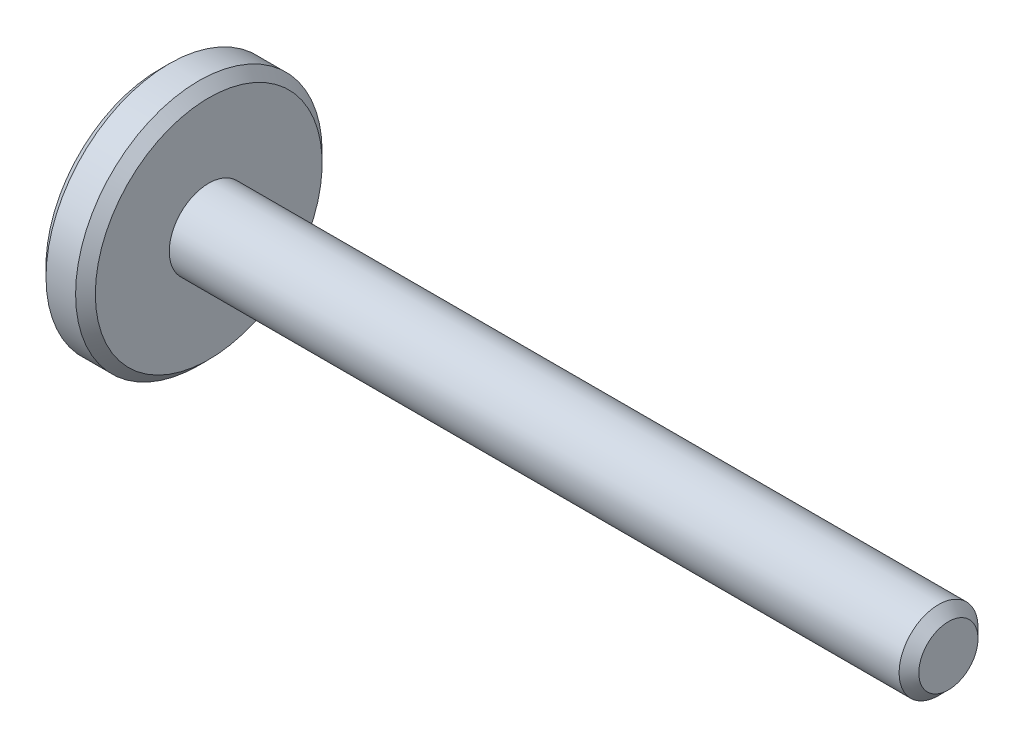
from build123d import *

# Parameters (mm, degrees)
CHANFREIN1_SIZE = 1


with BuildPart() as part:
    # Esquisse1 → R_volution1 (revolve)
    with BuildSketch(Plane.XY, mode=Mode.PRIVATE) as r_volution1_sk:
        Polygon((0, 0), (0, 12.5), (5, 12.5), (5, 4), (80, 4), (80, 0), align=None)
    revolve(r_volution1_sk.sketch.rotate(Axis((-12.320133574, 0, 0), (1, 0, 0)), 90), axis=Axis((-12.320133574, 0, 0), (1, 0, 0)))

    # Chanfrein1
    chanfrein1_edges = [part.edges().sort_by_distance(p)[0] for p in [
        (80, 0, -4),
        (5, 0, -12.5),
        (0, 0, -12.5),
    ]]
    chamfer(chanfrein1_edges, length=CHANFREIN1_SIZE)


solid = part.part
